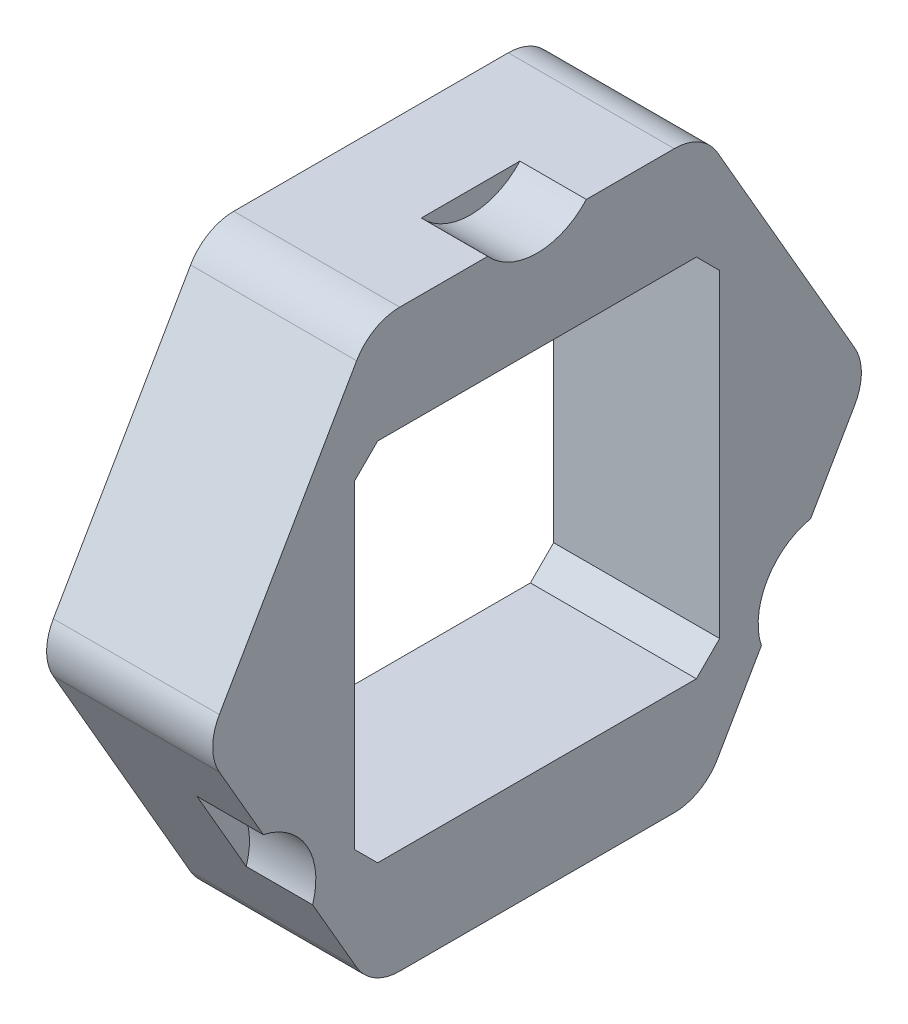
from build123d import *

# Parameters (mm, degrees)
SKETCH1_W           = 27.94
SKETCH1_H           = 27.94
BOSS_EXTRUDE1_DEPTH = 12.7
FILLET1_R           = 3.81
SKETCH2_R           = 5.08
CUT_EXTRUDE1_DEPTH  = 5.08
CIRPATTERN1_COUNT   = 3


with BuildPart() as part:
    # Sketch1 → Boss-Extrude1 (new body)
    # profile 1 of 5: a face of its own
    with BuildSketch(Plane(origin=(0, 0, 0), x_dir=(0, 0, -1), z_dir=(1, 0, 0))):
        Polygon((-12.7, -21.997045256), (12.7, -21.997045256), (25.4, 0), (12.7, 21.997045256), (-12.7, 21.997045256), (-25.4, 0), align=None)
        Rectangle(SKETCH1_W, SKETCH1_H, mode=Mode.SUBTRACT)
    # profile 2 of 5: a face of its own
    with BuildSketch(Plane(origin=(0, 0, 0), x_dir=(0, 0, -1), z_dir=(1, 0, 0))):
        Polygon((13.97, 13.97), (12.192, 13.97), (13.97, 12.192), align=None)
    # profile 3 of 5: a face of its own
    with BuildSketch(Plane(origin=(0, 0, 0), x_dir=(0, 0, -1), z_dir=(1, 0, 0))):
        Polygon((-13.97, 13.97), (-13.97, 12.192), (-12.192, 13.97), align=None)
    # profile 4 of 5: a face of its own
    with BuildSketch(Plane(origin=(0, 0, 0), x_dir=(0, 0, -1), z_dir=(1, 0, 0))):
        Polygon((-12.192, -13.97), (-13.97, -12.192), (-13.97, -13.97), align=None)
    # profile 5 of 5: a face of its own
    with BuildSketch(Plane(origin=(0, 0, 0), x_dir=(0, 0, -1), z_dir=(1, 0, 0))):
        Polygon((13.97, -12.192), (12.192, -13.97), (13.97, -13.97), align=None)
    extrude(amount=BOSS_EXTRUDE1_DEPTH)

    # Fillet1
    fillet1_edges = [part.edges().sort_by_distance(p)[0] for p in [
        (6.35, -21.997045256, 12.7),
        (6.35, 0, 25.4),
        (6.35, 21.997045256, 12.7),
        (6.35, 21.997045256, -12.7),
        (6.35, 0, -25.4),
        (6.35, -21.997045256, -12.7),
    ]]
    fillet(fillet1_edges, radius=FILLET1_R)

    # Sketch2 → Cut-Extrude1 (cut)
    with BuildSketch(Plane(origin=(12.7, 0, 0), x_dir=(0, 0, -1), z_dir=(1, 0, 0))):
        with Locations((0, 25.4)):
            Circle(SKETCH2_R)
    cut_extrude1 = extrude(amount=-CUT_EXTRUDE1_DEPTH, mode=Mode.SUBTRACT)

    # CirPattern1: Cut-Extrude1 ×3 about axis
    cirpattern1_axis = Axis((0, 0, 0), (1, 0, 0))
    for i in range(1, CIRPATTERN1_COUNT):
        add(cut_extrude1.rotate(cirpattern1_axis, i * 360 / CIRPATTERN1_COUNT), mode=Mode.SUBTRACT)


solid = part.part
